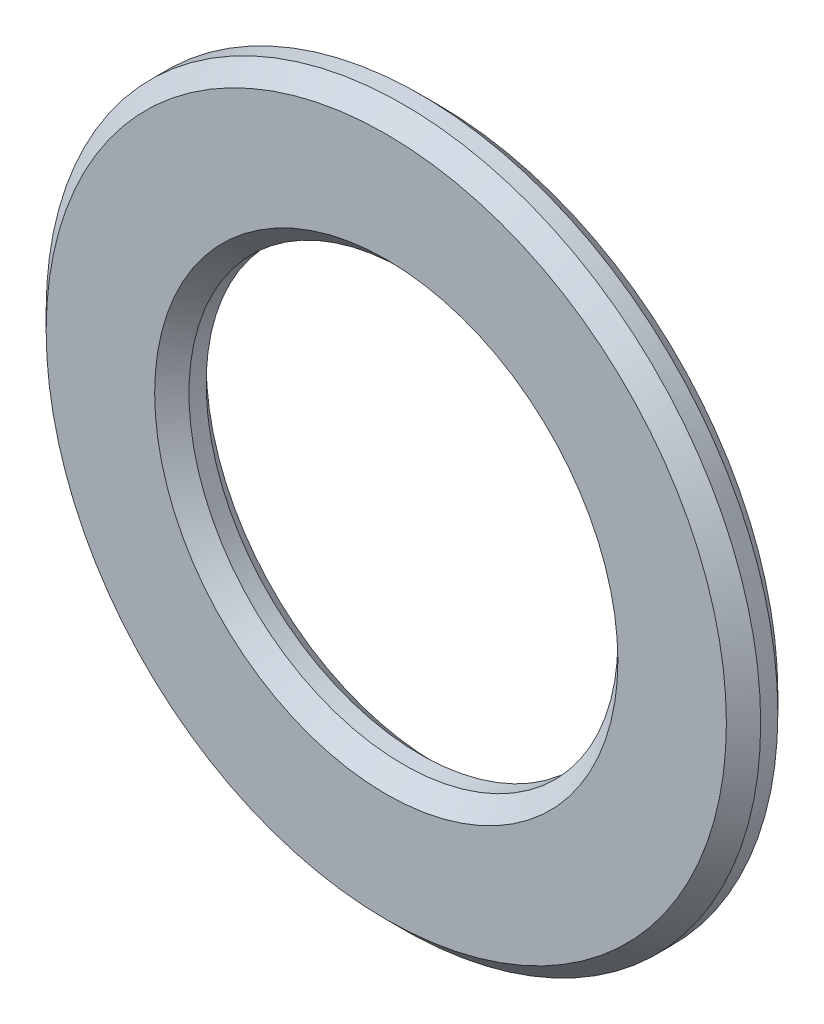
ISO-10303-21;
HEADER;
FILE_DESCRIPTION(('STEP AP214'),'2;1');
FILE_NAME('part.step','',(''),(''),'','','');
FILE_SCHEMA(('AUTOMOTIVE_DESIGN { 1 0 10303 214 1 1 1 1 }'));
ENDSEC;
DATA;
#1=APPLICATION_CONTEXT('core data for automotive mechanical design processes');
#2=APPLICATION_PROTOCOL_DEFINITION('international standard','automotive_design',2000,#1);
#3=PRODUCT_CONTEXT('',#1,'mechanical');
#4=PRODUCT('Part','Part','',(#3));
#5=PRODUCT_RELATED_PRODUCT_CATEGORY('part','',(#4));
#6=PRODUCT_DEFINITION_FORMATION('','',#4);
#7=PRODUCT_DEFINITION_CONTEXT('part definition',#1,'design');
#8=PRODUCT_DEFINITION('design','',#6,#7);
#9=PRODUCT_DEFINITION_SHAPE('','',#8);
#10=(LENGTH_UNIT() NAMED_UNIT(*) SI_UNIT(.MILLI.,.METRE.));
#11=(NAMED_UNIT(*) PLANE_ANGLE_UNIT() SI_UNIT($,.RADIAN.));
#12=(NAMED_UNIT(*) SI_UNIT($,.STERADIAN.) SOLID_ANGLE_UNIT());
#13=UNCERTAINTY_MEASURE_WITH_UNIT(LENGTH_MEASURE(1.E-05),#10,'distance_accuracy_value','');
#14=(GEOMETRIC_REPRESENTATION_CONTEXT(3) GLOBAL_UNCERTAINTY_ASSIGNED_CONTEXT((#13)) GLOBAL_UNIT_ASSIGNED_CONTEXT((#10,
#11,#12)) REPRESENTATION_CONTEXT('',''));
#15=CARTESIAN_POINT('',(0.,0.,0.));
#16=DIRECTION('',(0.,0.,1.));
#17=DIRECTION('',(1.,0.,0.));
#18=AXIS2_PLACEMENT_3D('',#15,#16,#17);
#19=CARTESIAN_POINT('',(0.,0.,3.));
#20=DIRECTION('',(0.,0.,1.));
#21=DIRECTION('',(1.,0.,0.));
#22=AXIS2_PLACEMENT_3D('',#19,#20,#21);
#23=PLANE('',#22);
#24=CARTESIAN_POINT('',(0.,0.,3.));
#25=DIRECTION('',(0.,0.,1.));
#26=DIRECTION('',(1.,0.,0.));
#27=AXIS2_PLACEMENT_3D('',#24,#25,#26);
#28=CIRCLE('',#27,13.5);
#29=CARTESIAN_POINT('',(13.5,0.,3.));
#30=VERTEX_POINT('',#29);
#31=EDGE_CURVE('E10',#30,#30,#28,.F.);
#32=ORIENTED_EDGE('',*,*,#31,.T.);
#33=EDGE_LOOP('',(#32));
#34=FACE_BOUND('',#33,.T.);
#35=CARTESIAN_POINT('',(0.,0.,3.));
#36=DIRECTION('',(0.,0.,1.));
#37=DIRECTION('',(1.,0.,0.));
#38=AXIS2_PLACEMENT_3D('',#35,#36,#37);
#39=CIRCLE('',#38,19.825);
#40=CARTESIAN_POINT('',(19.825,0.,3.));
#41=VERTEX_POINT('',#40);
#42=EDGE_CURVE('E37',#41,#41,#39,.T.);
#43=ORIENTED_EDGE('',*,*,#42,.T.);
#44=EDGE_LOOP('',(#43));
#45=FACE_BOUND('',#44,.T.);
#46=ADVANCED_FACE('F30',(#34,#45),#23,.T.);
#47=CARTESIAN_POINT('',(0.,0.,0.));
#48=DIRECTION('',(0.,0.,1.));
#49=DIRECTION('',(1.,0.,0.));
#50=AXIS2_PLACEMENT_3D('',#47,#48,#49);
#51=PLANE('',#50);
#52=CARTESIAN_POINT('',(0.,0.,0.));
#53=DIRECTION('',(0.,0.,1.));
#54=DIRECTION('',(1.,0.,0.));
#55=AXIS2_PLACEMENT_3D('',#52,#53,#54);
#56=CIRCLE('',#55,13.5);
#57=CARTESIAN_POINT('',(13.5,0.,0.));
#58=VERTEX_POINT('',#57);
#59=EDGE_CURVE('E56',#58,#58,#56,.T.);
#60=ORIENTED_EDGE('',*,*,#59,.T.);
#61=EDGE_LOOP('',(#60));
#62=FACE_BOUND('',#61,.T.);
#63=CARTESIAN_POINT('',(0.,0.,0.));
#64=DIRECTION('',(0.,0.,1.));
#65=DIRECTION('',(1.,0.,0.));
#66=AXIS2_PLACEMENT_3D('',#63,#64,#65);
#67=CIRCLE('',#66,19.825);
#68=CARTESIAN_POINT('',(19.825,0.,0.));
#69=VERTEX_POINT('',#68);
#70=EDGE_CURVE('E59',#69,#69,#67,.F.);
#71=ORIENTED_EDGE('',*,*,#70,.T.);
#72=EDGE_LOOP('',(#71));
#73=FACE_BOUND('',#72,.T.);
#74=ADVANCED_FACE('F63',(#62,#73),#51,.F.);
#75=CARTESIAN_POINT('',(0.,0.,3.));
#76=DIRECTION('',(0.,0.,-1.));
#77=DIRECTION('',(-1.,0.,0.));
#78=AXIS2_PLACEMENT_3D('',#75,#76,#77);
#79=CYLINDRICAL_SURFACE('',#78,20.825);
#80=CARTESIAN_POINT('',(0.,0.,1.));
#81=DIRECTION('',(0.,0.,1.));
#82=DIRECTION('',(1.,0.,0.));
#83=AXIS2_PLACEMENT_3D('',#80,#81,#82);
#84=CIRCLE('',#83,20.825);
#85=CARTESIAN_POINT('',(20.825,0.,1.));
#86=VERTEX_POINT('',#85);
#87=EDGE_CURVE('E41',#86,#86,#84,.T.);
#88=ORIENTED_EDGE('',*,*,#87,.T.);
#89=EDGE_LOOP('',(#88));
#90=FACE_BOUND('',#89,.T.);
#91=CARTESIAN_POINT('',(0.,0.,1.99999999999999));
#92=DIRECTION('',(0.,0.,1.));
#93=DIRECTION('',(1.,0.,0.));
#94=AXIS2_PLACEMENT_3D('',#91,#92,#93);
#95=CIRCLE('',#94,20.825);
#96=CARTESIAN_POINT('',(20.825,0.,1.99999999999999));
#97=VERTEX_POINT('',#96);
#98=EDGE_CURVE('E45',#97,#97,#95,.F.);
#99=ORIENTED_EDGE('',*,*,#98,.T.);
#100=EDGE_LOOP('',(#99));
#101=FACE_BOUND('',#100,.T.);
#102=ADVANCED_FACE('F73',(#90,#101),#79,.T.);
#103=CARTESIAN_POINT('',(0.,0.,3.));
#104=DIRECTION('',(0.,0.,-1.));
#105=DIRECTION('',(-1.,0.,0.));
#106=AXIS2_PLACEMENT_3D('',#103,#104,#105);
#107=CYLINDRICAL_SURFACE('',#106,12.5);
#108=CARTESIAN_POINT('',(0.,0.,1.));
#109=DIRECTION('',(0.,0.,1.));
#110=DIRECTION('',(1.,0.,0.));
#111=AXIS2_PLACEMENT_3D('',#108,#109,#110);
#112=CIRCLE('',#111,12.5);
#113=CARTESIAN_POINT('',(12.5,0.,1.));
#114=VERTEX_POINT('',#113);
#115=EDGE_CURVE('E50',#114,#114,#112,.F.);
#116=ORIENTED_EDGE('',*,*,#115,.T.);
#117=EDGE_LOOP('',(#116));
#118=FACE_BOUND('',#117,.T.);
#119=CARTESIAN_POINT('',(0.,0.,2.));
#120=DIRECTION('',(0.,0.,1.));
#121=DIRECTION('',(1.,0.,0.));
#122=AXIS2_PLACEMENT_3D('',#119,#120,#121);
#123=CIRCLE('',#122,12.5);
#124=CARTESIAN_POINT('',(12.5,0.,2.));
#125=VERTEX_POINT('',#124);
#126=EDGE_CURVE('E53',#125,#125,#123,.T.);
#127=ORIENTED_EDGE('',*,*,#126,.T.);
#128=EDGE_LOOP('',(#127));
#129=FACE_BOUND('',#128,.T.);
#130=ADVANCED_FACE('F76',(#118,#129),#107,.F.);
#131=CARTESIAN_POINT('',(0.,0.,0.));
#132=DIRECTION('',(0.,0.,-1.));
#133=DIRECTION('',(-1.,0.,0.));
#134=AXIS2_PLACEMENT_3D('',#131,#132,#133);
#135=CONICAL_SURFACE('',#134,13.5,0.785398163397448);
#136=ORIENTED_EDGE('',*,*,#115,.F.);
#137=EDGE_LOOP('',(#136));
#138=FACE_BOUND('',#137,.T.);
#139=ORIENTED_EDGE('',*,*,#59,.F.);
#140=EDGE_LOOP('',(#139));
#141=FACE_BOUND('',#140,.T.);
#142=ADVANCED_FACE('F69',(#138,#141),#135,.F.);
#143=CARTESIAN_POINT('',(0.,0.,1.));
#144=DIRECTION('',(0.,0.,1.));
#145=DIRECTION('',(1.,0.,0.));
#146=AXIS2_PLACEMENT_3D('',#143,#144,#145);
#147=CONICAL_SURFACE('',#146,20.825,0.785398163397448);
#148=ORIENTED_EDGE('',*,*,#70,.F.);
#149=EDGE_LOOP('',(#148));
#150=FACE_BOUND('',#149,.T.);
#151=ORIENTED_EDGE('',*,*,#87,.F.);
#152=EDGE_LOOP('',(#151));
#153=FACE_BOUND('',#152,.T.);
#154=ADVANCED_FACE('F65',(#150,#153),#147,.T.);
#155=CARTESIAN_POINT('',(0.,0.,2.));
#156=DIRECTION('',(0.,0.,1.));
#157=DIRECTION('',(1.,0.,0.));
#158=AXIS2_PLACEMENT_3D('',#155,#156,#157);
#159=CONICAL_SURFACE('',#158,12.5,0.785398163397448);
#160=ORIENTED_EDGE('',*,*,#31,.F.);
#161=EDGE_LOOP('',(#160));
#162=FACE_BOUND('',#161,.T.);
#163=ORIENTED_EDGE('',*,*,#126,.F.);
#164=EDGE_LOOP('',(#163));
#165=FACE_BOUND('',#164,.T.);
#166=ADVANCED_FACE('F68',(#162,#165),#159,.F.);
#167=CARTESIAN_POINT('',(0.,0.,3.));
#168=DIRECTION('',(0.,0.,-1.));
#169=DIRECTION('',(-1.,0.,0.));
#170=AXIS2_PLACEMENT_3D('',#167,#168,#169);
#171=CONICAL_SURFACE('',#170,19.825,0.785398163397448);
#172=ORIENTED_EDGE('',*,*,#98,.F.);
#173=EDGE_LOOP('',(#172));
#174=FACE_BOUND('',#173,.T.);
#175=ORIENTED_EDGE('',*,*,#42,.F.);
#176=EDGE_LOOP('',(#175));
#177=FACE_BOUND('',#176,.T.);
#178=ADVANCED_FACE('F32',(#174,#177),#171,.T.);
#179=CLOSED_SHELL('',(#46,#74,#102,#130,#142,#154,#166,#178));
#180=MANIFOLD_SOLID_BREP('B2',#179);
#181=ADVANCED_BREP_SHAPE_REPRESENTATION('',(#18,#180),#14);
#182=SHAPE_DEFINITION_REPRESENTATION(#9,#181);
ENDSEC;
END-ISO-10303-21;
